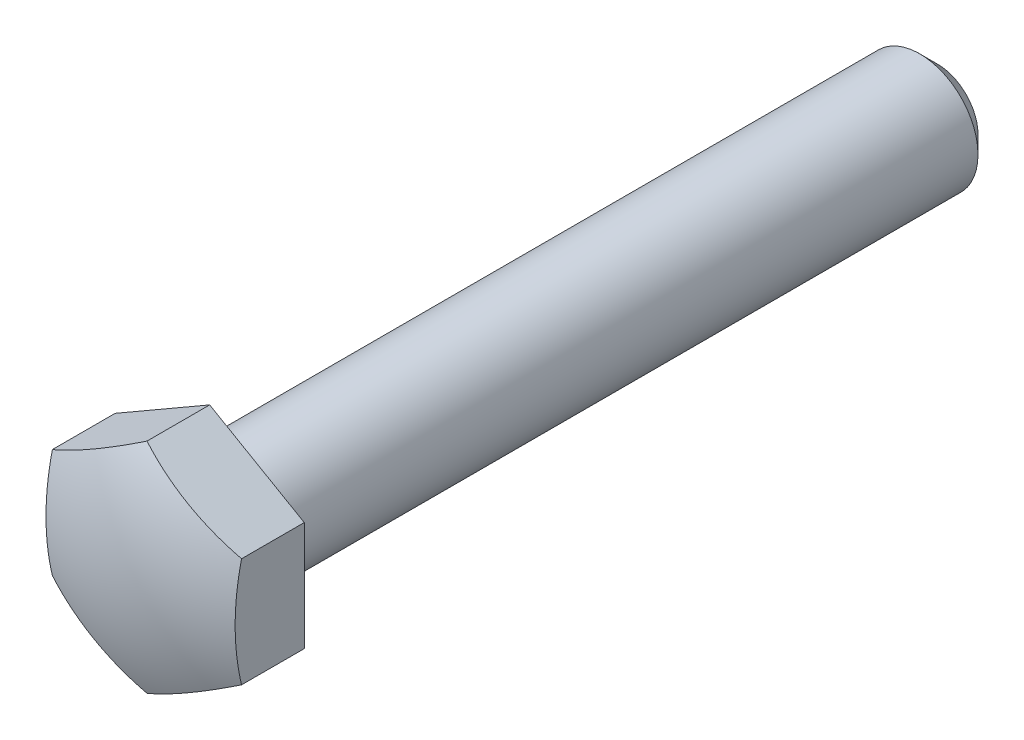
ISO-10303-21;
HEADER;
FILE_DESCRIPTION(('STEP AP214'),'2;1');
FILE_NAME('part.step','',(''),(''),'','','');
FILE_SCHEMA(('AUTOMOTIVE_DESIGN { 1 0 10303 214 1 1 1 1 }'));
ENDSEC;
DATA;
#1=APPLICATION_CONTEXT('core data for automotive mechanical design processes');
#2=APPLICATION_PROTOCOL_DEFINITION('international standard','automotive_design',2000,#1);
#3=PRODUCT_CONTEXT('',#1,'mechanical');
#4=PRODUCT('Part','Part','',(#3));
#5=PRODUCT_RELATED_PRODUCT_CATEGORY('part','',(#4));
#6=PRODUCT_DEFINITION_FORMATION('','',#4);
#7=PRODUCT_DEFINITION_CONTEXT('part definition',#1,'design');
#8=PRODUCT_DEFINITION('design','',#6,#7);
#9=PRODUCT_DEFINITION_SHAPE('','',#8);
#10=(LENGTH_UNIT() NAMED_UNIT(*) SI_UNIT(.MILLI.,.METRE.));
#11=(NAMED_UNIT(*) PLANE_ANGLE_UNIT() SI_UNIT($,.RADIAN.));
#12=(NAMED_UNIT(*) SI_UNIT($,.STERADIAN.) SOLID_ANGLE_UNIT());
#13=UNCERTAINTY_MEASURE_WITH_UNIT(LENGTH_MEASURE(1.E-05),#10,'distance_accuracy_value','');
#14=(GEOMETRIC_REPRESENTATION_CONTEXT(3) GLOBAL_UNCERTAINTY_ASSIGNED_CONTEXT((#13)) GLOBAL_UNIT_ASSIGNED_CONTEXT((#10,
#11,#12)) REPRESENTATION_CONTEXT('',''));
#15=CARTESIAN_POINT('',(0.,0.,0.));
#16=DIRECTION('',(0.,0.,1.));
#17=DIRECTION('',(1.,0.,0.));
#18=AXIS2_PLACEMENT_3D('',#15,#16,#17);
#19=CARTESIAN_POINT('',(4.,0.,0.));
#20=DIRECTION('',(0.,0.,1.));
#21=DIRECTION('',(1.,0.,0.));
#22=AXIS2_PLACEMENT_3D('',#19,#20,#21);
#23=PLANE('',#22);
#24=CARTESIAN_POINT('',(0.,0.,0.));
#25=DIRECTION('',(0.,0.,1.));
#26=DIRECTION('',(1.,0.,0.));
#27=AXIS2_PLACEMENT_3D('',#24,#25,#26);
#28=CIRCLE('',#27,4.);
#29=CARTESIAN_POINT('',(4.,0.,0.));
#30=VERTEX_POINT('',#29);
#31=EDGE_CURVE('E115',#30,#30,#28,.T.);
#32=ORIENTED_EDGE('',*,*,#31,.T.);
#33=EDGE_LOOP('',(#32));
#34=FACE_BOUND('',#33,.T.);
#35=DIRECTION('',(-0.86602540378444,-0.5,0.));
#36=VECTOR('',#35,1.);
#37=CARTESIAN_POINT('',(6.5,-3.75277674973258,0.));
#38=LINE('',#37,#36);
#39=CARTESIAN_POINT('',(6.5,-3.75277674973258,0.));
#40=VERTEX_POINT('',#39);
#41=CARTESIAN_POINT('',(0.,-7.50555349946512,0.));
#42=VERTEX_POINT('',#41);
#43=EDGE_CURVE('E89',#40,#42,#38,.T.);
#44=ORIENTED_EDGE('',*,*,#43,.T.);
#45=DIRECTION('',(0.86602540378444,-0.5,0.));
#46=VECTOR('',#45,1.);
#47=CARTESIAN_POINT('',(-6.5,-3.75277674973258,0.));
#48=LINE('',#47,#46);
#49=CARTESIAN_POINT('',(-6.5,-3.75277674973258,0.));
#50=VERTEX_POINT('',#49);
#51=EDGE_CURVE('E87',#50,#42,#48,.T.);
#52=ORIENTED_EDGE('',*,*,#51,.F.);
#53=DIRECTION('',(0.,-1.,0.));
#54=VECTOR('',#53,1.);
#55=CARTESIAN_POINT('',(-6.5,3.75277674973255,0.));
#56=LINE('',#55,#54);
#57=CARTESIAN_POINT('',(-6.5,3.75277674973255,0.));
#58=VERTEX_POINT('',#57);
#59=EDGE_CURVE('E37',#58,#50,#56,.T.);
#60=ORIENTED_EDGE('',*,*,#59,.F.);
#61=DIRECTION('',(0.866025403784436,0.5,0.));
#62=VECTOR('',#61,1.);
#63=CARTESIAN_POINT('',(-6.5,3.75277674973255,0.));
#64=LINE('',#63,#62);
#65=CARTESIAN_POINT('',(0.,7.50555349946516,0.));
#66=VERTEX_POINT('',#65);
#67=EDGE_CURVE('E77',#58,#66,#64,.T.);
#68=ORIENTED_EDGE('',*,*,#67,.T.);
#69=DIRECTION('',(-0.866025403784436,0.5,0.));
#70=VECTOR('',#69,1.);
#71=CARTESIAN_POINT('',(6.5,3.75277674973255,0.));
#72=LINE('',#71,#70);
#73=CARTESIAN_POINT('',(6.5,3.75277674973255,0.));
#74=VERTEX_POINT('',#73);
#75=EDGE_CURVE('E83',#74,#66,#72,.T.);
#76=ORIENTED_EDGE('',*,*,#75,.F.);
#77=DIRECTION('',(0.,-1.,0.));
#78=VECTOR('',#77,1.);
#79=CARTESIAN_POINT('',(6.5,3.75277674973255,0.));
#80=LINE('',#79,#78);
#81=EDGE_CURVE('E95',#74,#40,#80,.T.);
#82=ORIENTED_EDGE('',*,*,#81,.T.);
#83=EDGE_LOOP('',(#44,#52,#60,#68,#76,#82));
#84=FACE_BOUND('',#83,.T.);
#85=ADVANCED_FACE('F14',(#34,#84),#23,.F.);
#86=CARTESIAN_POINT('',(0.,0.,10.));
#87=DIRECTION('',(0.,0.,1.));
#88=DIRECTION('',(1.,0.,0.));
#89=AXIS2_PLACEMENT_3D('',#86,#87,#88);
#90=CYLINDRICAL_SURFACE('',#89,4.);
#91=CARTESIAN_POINT('',(0.,0.,-48.8));
#92=DIRECTION('',(0.,0.,1.));
#93=DIRECTION('',(1.,0.,0.));
#94=AXIS2_PLACEMENT_3D('',#91,#92,#93);
#95=CIRCLE('',#94,4.);
#96=CARTESIAN_POINT('',(4.,0.,-48.8));
#97=VERTEX_POINT('',#96);
#98=EDGE_CURVE('E22',#97,#97,#95,.T.);
#99=ORIENTED_EDGE('',*,*,#98,.T.);
#100=EDGE_LOOP('',(#99));
#101=FACE_BOUND('',#100,.T.);
#102=ORIENTED_EDGE('',*,*,#31,.F.);
#103=EDGE_LOOP('',(#102));
#104=FACE_BOUND('',#103,.T.);
#105=ADVANCED_FACE('F120',(#101,#104),#90,.T.);
#106=CARTESIAN_POINT('',(0.,0.,-50.));
#107=DIRECTION('',(0.,0.,1.));
#108=DIRECTION('',(1.,0.,0.));
#109=AXIS2_PLACEMENT_3D('',#106,#107,#108);
#110=PLANE('',#109);
#111=CARTESIAN_POINT('',(0.,0.,-50.));
#112=DIRECTION('',(0.,0.,1.));
#113=DIRECTION('',(1.,0.,0.));
#114=AXIS2_PLACEMENT_3D('',#111,#112,#113);
#115=CIRCLE('',#114,2.8);
#116=CARTESIAN_POINT('',(2.8,0.,-50.));
#117=VERTEX_POINT('',#116);
#118=EDGE_CURVE('E9',#117,#117,#115,.F.);
#119=ORIENTED_EDGE('',*,*,#118,.T.);
#120=EDGE_LOOP('',(#119));
#121=FACE_BOUND('',#120,.T.);
#122=ADVANCED_FACE('F141',(#121),#110,.F.);
#123=CARTESIAN_POINT('',(6.5,-3.75277674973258,6.));
#124=DIRECTION('',(0.5,-0.86602540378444,0.));
#125=DIRECTION('',(0.86602540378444,0.5,0.));
#126=AXIS2_PLACEMENT_3D('',#123,#124,#125);
#127=PLANE('',#126);
#128=DIRECTION('',(0.,0.,-1.));
#129=VECTOR('',#128,1.);
#130=CARTESIAN_POINT('',(0.,-7.50555349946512,6.));
#131=LINE('',#130,#129);
#132=CARTESIAN_POINT('',(0.,-7.50555349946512,4.30875284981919));
#133=VERTEX_POINT('',#132);
#134=EDGE_CURVE('E29',#133,#42,#131,.T.);
#135=ORIENTED_EDGE('',*,*,#134,.T.);
#136=ORIENTED_EDGE('',*,*,#43,.F.);
#137=DIRECTION('',(0.,0.,-1.));
#138=VECTOR('',#137,1.);
#139=CARTESIAN_POINT('',(6.5,-3.75277674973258,6.));
#140=LINE('',#139,#138);
#141=CARTESIAN_POINT('',(6.5,-3.75277674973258,4.30875284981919));
#142=VERTEX_POINT('',#141);
#143=EDGE_CURVE('E100',#142,#40,#140,.T.);
#144=ORIENTED_EDGE('',*,*,#143,.F.);
#145=CARTESIAN_POINT('',(3.25,-5.62916512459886,-11.5));
#146=DIRECTION('',(0.5,-0.86602540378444,0.));
#147=DIRECTION('',(0.86602540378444,0.5,0.));
#148=AXIS2_PLACEMENT_3D('',#145,#146,#147);
#149=CIRCLE('',#148,16.248076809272);
#150=EDGE_CURVE('E112',#133,#142,#149,.F.);
#151=ORIENTED_EDGE('',*,*,#150,.F.);
#152=EDGE_LOOP('',(#135,#136,#144,#151));
#153=FACE_BOUND('',#152,.T.);
#154=ADVANCED_FACE('F146',(#153),#127,.T.);
#155=CARTESIAN_POINT('',(6.5,3.75277674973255,6.));
#156=DIRECTION('',(1.,0.,0.));
#157=DIRECTION('',(0.,1.,0.));
#158=AXIS2_PLACEMENT_3D('',#155,#156,#157);
#159=PLANE('',#158);
#160=ORIENTED_EDGE('',*,*,#143,.T.);
#161=ORIENTED_EDGE('',*,*,#81,.F.);
#162=DIRECTION('',(0.,0.,-1.));
#163=VECTOR('',#162,1.);
#164=CARTESIAN_POINT('',(6.5,3.75277674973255,6.));
#165=LINE('',#164,#163);
#166=CARTESIAN_POINT('',(6.5,3.75277674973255,4.30875284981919));
#167=VERTEX_POINT('',#166);
#168=EDGE_CURVE('E98',#167,#74,#165,.T.);
#169=ORIENTED_EDGE('',*,*,#168,.F.);
#170=CARTESIAN_POINT('',(6.5,0.,-11.5));
#171=DIRECTION('',(1.,0.,0.));
#172=DIRECTION('',(0.,1.,0.));
#173=AXIS2_PLACEMENT_3D('',#170,#171,#172);
#174=CIRCLE('',#173,16.248076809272);
#175=EDGE_CURVE('E109',#142,#167,#174,.F.);
#176=ORIENTED_EDGE('',*,*,#175,.F.);
#177=EDGE_LOOP('',(#160,#161,#169,#176));
#178=FACE_BOUND('',#177,.T.);
#179=ADVANCED_FACE('F148',(#178),#159,.T.);
#180=CARTESIAN_POINT('',(6.5,3.75277674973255,6.));
#181=DIRECTION('',(-0.5,-0.866025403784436,0.));
#182=DIRECTION('',(0.866025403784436,-0.5,0.));
#183=AXIS2_PLACEMENT_3D('',#180,#181,#182);
#184=PLANE('',#183);
#185=CARTESIAN_POINT('',(3.25,5.62916512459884,-11.5));
#186=DIRECTION('',(-0.5,-0.866025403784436,0.));
#187=DIRECTION('',(0.866025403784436,-0.5,0.));
#188=AXIS2_PLACEMENT_3D('',#185,#186,#187);
#189=CIRCLE('',#188,16.248076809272);
#190=CARTESIAN_POINT('',(0.,7.50555349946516,4.30875284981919));
#191=VERTEX_POINT('',#190);
#192=EDGE_CURVE('E107',#191,#167,#189,.F.);
#193=ORIENTED_EDGE('',*,*,#192,.T.);
#194=ORIENTED_EDGE('',*,*,#168,.T.);
#195=ORIENTED_EDGE('',*,*,#75,.T.);
#196=DIRECTION('',(0.,0.,-1.));
#197=VECTOR('',#196,1.);
#198=CARTESIAN_POINT('',(0.,7.50555349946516,6.));
#199=LINE('',#198,#197);
#200=EDGE_CURVE('E73',#191,#66,#199,.T.);
#201=ORIENTED_EDGE('',*,*,#200,.F.);
#202=EDGE_LOOP('',(#193,#194,#195,#201));
#203=FACE_BOUND('',#202,.T.);
#204=ADVANCED_FACE('F151',(#203),#184,.F.);
#205=CARTESIAN_POINT('',(-6.5,3.75277674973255,6.));
#206=DIRECTION('',(-0.5,0.866025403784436,0.));
#207=DIRECTION('',(-0.866025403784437,-0.5,0.));
#208=AXIS2_PLACEMENT_3D('',#205,#206,#207);
#209=PLANE('',#208);
#210=ORIENTED_EDGE('',*,*,#200,.T.);
#211=ORIENTED_EDGE('',*,*,#67,.F.);
#212=DIRECTION('',(0.,0.,-1.));
#213=VECTOR('',#212,1.);
#214=CARTESIAN_POINT('',(-6.5,3.75277674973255,6.));
#215=LINE('',#214,#213);
#216=CARTESIAN_POINT('',(-6.5,3.75277674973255,4.30875284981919));
#217=VERTEX_POINT('',#216);
#218=EDGE_CURVE('E66',#217,#58,#215,.T.);
#219=ORIENTED_EDGE('',*,*,#218,.F.);
#220=CARTESIAN_POINT('',(-3.25,5.62916512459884,-11.5));
#221=DIRECTION('',(-0.5,0.866025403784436,0.));
#222=DIRECTION('',(-0.866025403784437,-0.5,0.));
#223=AXIS2_PLACEMENT_3D('',#220,#221,#222);
#224=CIRCLE('',#223,16.248076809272);
#225=EDGE_CURVE('E105',#191,#217,#224,.F.);
#226=ORIENTED_EDGE('',*,*,#225,.F.);
#227=EDGE_LOOP('',(#210,#211,#219,#226));
#228=FACE_BOUND('',#227,.T.);
#229=ADVANCED_FACE('F78',(#228),#209,.T.);
#230=CARTESIAN_POINT('',(-6.5,3.75277674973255,6.));
#231=DIRECTION('',(1.,0.,0.));
#232=DIRECTION('',(0.,0.,-1.));
#233=AXIS2_PLACEMENT_3D('',#230,#231,#232);
#234=PLANE('',#233);
#235=CARTESIAN_POINT('',(-6.5,0.,-11.5));
#236=DIRECTION('',(1.,0.,0.));
#237=DIRECTION('',(0.,0.,-1.));
#238=AXIS2_PLACEMENT_3D('',#235,#236,#237);
#239=CIRCLE('',#238,16.248076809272);
#240=CARTESIAN_POINT('',(-6.5,-3.75277674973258,4.30875284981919));
#241=VERTEX_POINT('',#240);
#242=EDGE_CURVE('E70',#241,#217,#239,.F.);
#243=ORIENTED_EDGE('',*,*,#242,.T.);
#244=ORIENTED_EDGE('',*,*,#218,.T.);
#245=ORIENTED_EDGE('',*,*,#59,.T.);
#246=DIRECTION('',(0.,0.,-1.));
#247=VECTOR('',#246,1.);
#248=CARTESIAN_POINT('',(-6.5,-3.75277674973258,6.));
#249=LINE('',#248,#247);
#250=EDGE_CURVE('E74',#241,#50,#249,.T.);
#251=ORIENTED_EDGE('',*,*,#250,.F.);
#252=EDGE_LOOP('',(#243,#244,#245,#251));
#253=FACE_BOUND('',#252,.T.);
#254=ADVANCED_FACE('F68',(#253),#234,.F.);
#255=CARTESIAN_POINT('',(-6.5,-3.75277674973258,6.));
#256=DIRECTION('',(0.5,0.86602540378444,0.));
#257=DIRECTION('',(-0.86602540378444,0.5,0.));
#258=AXIS2_PLACEMENT_3D('',#255,#256,#257);
#259=PLANE('',#258);
#260=CARTESIAN_POINT('',(-3.25,-5.62916512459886,-11.5));
#261=DIRECTION('',(0.5,0.86602540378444,0.));
#262=DIRECTION('',(-0.86602540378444,0.5,0.));
#263=AXIS2_PLACEMENT_3D('',#260,#261,#262);
#264=CIRCLE('',#263,16.248076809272);
#265=EDGE_CURVE('E102',#133,#241,#264,.F.);
#266=ORIENTED_EDGE('',*,*,#265,.T.);
#267=ORIENTED_EDGE('',*,*,#250,.T.);
#268=ORIENTED_EDGE('',*,*,#51,.T.);
#269=ORIENTED_EDGE('',*,*,#134,.F.);
#270=EDGE_LOOP('',(#266,#267,#268,#269));
#271=FACE_BOUND('',#270,.T.);
#272=ADVANCED_FACE('F131',(#271),#259,.F.);
#273=CARTESIAN_POINT('',(0.,0.,-11.5));
#274=DIRECTION('',(0.,0.,1.));
#275=DIRECTION('',(1.,0.,0.));
#276=AXIS2_PLACEMENT_3D('',#273,#274,#275);
#277=SPHERICAL_SURFACE('',#276,17.5);
#278=ORIENTED_EDGE('',*,*,#265,.F.);
#279=ORIENTED_EDGE('',*,*,#150,.T.);
#280=ORIENTED_EDGE('',*,*,#175,.T.);
#281=ORIENTED_EDGE('',*,*,#192,.F.);
#282=ORIENTED_EDGE('',*,*,#225,.T.);
#283=ORIENTED_EDGE('',*,*,#242,.F.);
#284=EDGE_LOOP('',(#278,#279,#280,#281,#282,#283));
#285=FACE_BOUND('',#284,.T.);
#286=ADVANCED_FACE('F124',(#285),#277,.T.);
#287=CARTESIAN_POINT('',(0.,0.,-48.8));
#288=DIRECTION('',(0.,0.,1.));
#289=DIRECTION('',(1.,0.,0.));
#290=AXIS2_PLACEMENT_3D('',#287,#288,#289);
#291=CONICAL_SURFACE('',#290,4.,0.78539816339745);
#292=ORIENTED_EDGE('',*,*,#118,.F.);
#293=EDGE_LOOP('',(#292));
#294=FACE_BOUND('',#293,.T.);
#295=ORIENTED_EDGE('',*,*,#98,.F.);
#296=EDGE_LOOP('',(#295));
#297=FACE_BOUND('',#296,.T.);
#298=ADVANCED_FACE('F16',(#294,#297),#291,.T.);
#299=CLOSED_SHELL('',(#85,#105,#122,#154,#179,#204,#229,#254,#272,#286,#298));
#300=MANIFOLD_SOLID_BREP('B1',#299);
#301=ADVANCED_BREP_SHAPE_REPRESENTATION('',(#18,#300),#14);
#302=SHAPE_DEFINITION_REPRESENTATION(#9,#301);
ENDSEC;
END-ISO-10303-21;
